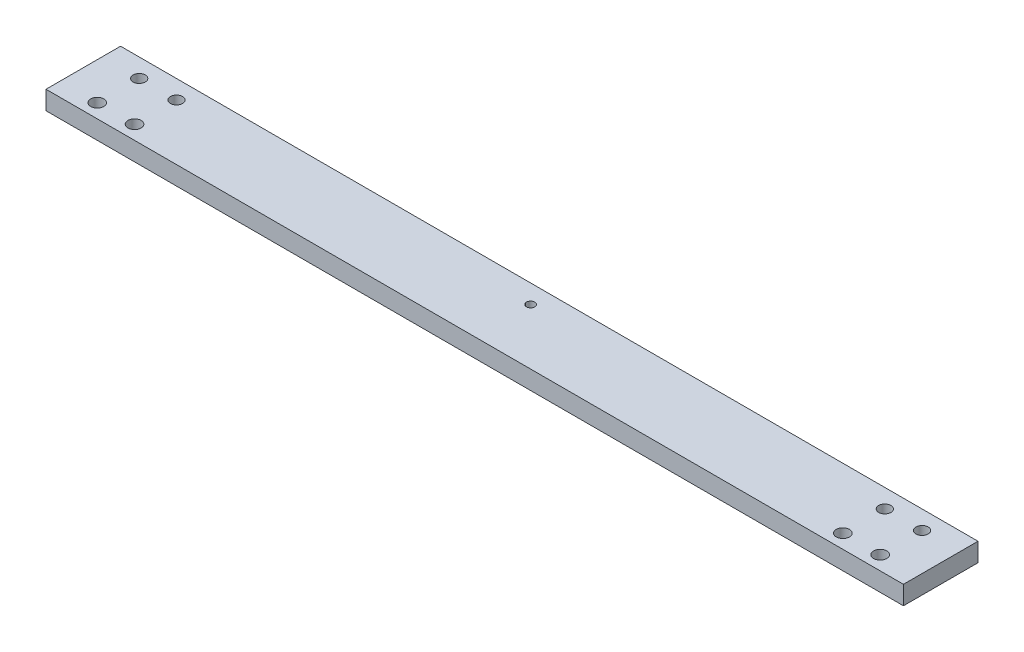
ISO-10303-21;
HEADER;
FILE_DESCRIPTION(('STEP AP214'),'2;1');
FILE_NAME('part.step','',(''),(''),'','','');
FILE_SCHEMA(('AUTOMOTIVE_DESIGN { 1 0 10303 214 1 1 1 1 }'));
ENDSEC;
DATA;
#1=APPLICATION_CONTEXT('core data for automotive mechanical design processes');
#2=APPLICATION_PROTOCOL_DEFINITION('international standard','automotive_design',2000,#1);
#3=PRODUCT_CONTEXT('',#1,'mechanical');
#4=PRODUCT('Part','Part','',(#3));
#5=PRODUCT_RELATED_PRODUCT_CATEGORY('part','',(#4));
#6=PRODUCT_DEFINITION_FORMATION('','',#4);
#7=PRODUCT_DEFINITION_CONTEXT('part definition',#1,'design');
#8=PRODUCT_DEFINITION('design','',#6,#7);
#9=PRODUCT_DEFINITION_SHAPE('','',#8);
#10=(LENGTH_UNIT() NAMED_UNIT(*) SI_UNIT(.MILLI.,.METRE.));
#11=(NAMED_UNIT(*) PLANE_ANGLE_UNIT() SI_UNIT($,.RADIAN.));
#12=(NAMED_UNIT(*) SI_UNIT($,.STERADIAN.) SOLID_ANGLE_UNIT());
#13=UNCERTAINTY_MEASURE_WITH_UNIT(LENGTH_MEASURE(1.E-05),#10,'distance_accuracy_value','');
#14=(GEOMETRIC_REPRESENTATION_CONTEXT(3) GLOBAL_UNCERTAINTY_ASSIGNED_CONTEXT((#13)) GLOBAL_UNIT_ASSIGNED_CONTEXT((#10,
#11,#12)) REPRESENTATION_CONTEXT('',''));
#15=CARTESIAN_POINT('',(0.,0.,0.));
#16=DIRECTION('',(0.,0.,1.));
#17=DIRECTION('',(1.,0.,0.));
#18=AXIS2_PLACEMENT_3D('',#15,#16,#17);
#19=CARTESIAN_POINT('',(0.,6.35,0.));
#20=DIRECTION('',(0.,-1.,0.));
#21=DIRECTION('',(0.,0.,-1.));
#22=AXIS2_PLACEMENT_3D('',#19,#20,#21);
#23=PLANE('',#22);
#24=CARTESIAN_POINT('',(0.,6.35,0.));
#25=DIRECTION('',(0.,1.,0.));
#26=DIRECTION('',(0.,0.,1.));
#27=AXIS2_PLACEMENT_3D('',#24,#25,#26);
#28=CIRCLE('',#27,1.42239999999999);
#29=CARTESIAN_POINT('',(0.,6.35,1.42239999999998));
#30=VERTEX_POINT('',#29);
#31=EDGE_CURVE('E162',#30,#30,#28,.T.);
#32=ORIENTED_EDGE('',*,*,#31,.F.);
#33=EDGE_LOOP('',(#32));
#34=FACE_BOUND('',#33,.T.);
#35=CARTESIAN_POINT('',(120.65,6.35,0.));
#36=DIRECTION('',(0.,1.,0.));
#37=DIRECTION('',(0.,0.,1.));
#38=AXIS2_PLACEMENT_3D('',#35,#36,#37);
#39=CIRCLE('',#38,2.08279999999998);
#40=CARTESIAN_POINT('',(120.65,6.35,2.08279999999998));
#41=VERTEX_POINT('',#40);
#42=EDGE_CURVE('E150',#41,#41,#39,.T.);
#43=ORIENTED_EDGE('',*,*,#42,.F.);
#44=EDGE_LOOP('',(#43));
#45=FACE_BOUND('',#44,.T.);
#46=CARTESIAN_POINT('',(133.35,6.35,14.2875));
#47=DIRECTION('',(0.,1.,0.));
#48=DIRECTION('',(0.,0.,1.));
#49=AXIS2_PLACEMENT_3D('',#46,#47,#48);
#50=CIRCLE('',#49,2.2479);
#51=CARTESIAN_POINT('',(133.35,6.35,16.5354));
#52=VERTEX_POINT('',#51);
#53=EDGE_CURVE('E144',#52,#52,#50,.T.);
#54=ORIENTED_EDGE('',*,*,#53,.F.);
#55=EDGE_LOOP('',(#54));
#56=FACE_BOUND('',#55,.T.);
#57=CARTESIAN_POINT('',(120.65,6.35,14.2875));
#58=DIRECTION('',(0.,1.,0.));
#59=DIRECTION('',(0.,0.,1.));
#60=AXIS2_PLACEMENT_3D('',#57,#58,#59);
#61=CIRCLE('',#60,2.2479);
#62=CARTESIAN_POINT('',(120.65,6.35,16.5354));
#63=VERTEX_POINT('',#62);
#64=EDGE_CURVE('E138',#63,#63,#61,.T.);
#65=ORIENTED_EDGE('',*,*,#64,.F.);
#66=EDGE_LOOP('',(#65));
#67=FACE_BOUND('',#66,.T.);
#68=CARTESIAN_POINT('',(-133.35,6.35,0.));
#69=DIRECTION('',(0.,1.,0.));
#70=DIRECTION('',(0.,0.,1.));
#71=AXIS2_PLACEMENT_3D('',#68,#69,#70);
#72=CIRCLE('',#71,2.0828);
#73=CARTESIAN_POINT('',(-133.35,6.35,2.08279999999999));
#74=VERTEX_POINT('',#73);
#75=EDGE_CURVE('E132',#74,#74,#72,.T.);
#76=ORIENTED_EDGE('',*,*,#75,.F.);
#77=EDGE_LOOP('',(#76));
#78=FACE_BOUND('',#77,.T.);
#79=CARTESIAN_POINT('',(-120.65,6.35,0.));
#80=DIRECTION('',(0.,1.,0.));
#81=DIRECTION('',(0.,0.,1.));
#82=AXIS2_PLACEMENT_3D('',#79,#80,#81);
#83=CIRCLE('',#82,2.08279999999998);
#84=CARTESIAN_POINT('',(-120.65,6.35,2.08279999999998));
#85=VERTEX_POINT('',#84);
#86=EDGE_CURVE('E126',#85,#85,#83,.T.);
#87=ORIENTED_EDGE('',*,*,#86,.F.);
#88=EDGE_LOOP('',(#87));
#89=FACE_BOUND('',#88,.T.);
#90=CARTESIAN_POINT('',(-133.35,6.35,14.2875));
#91=DIRECTION('',(0.,1.,0.));
#92=DIRECTION('',(0.,0.,1.));
#93=AXIS2_PLACEMENT_3D('',#90,#91,#92);
#94=CIRCLE('',#93,2.2479);
#95=CARTESIAN_POINT('',(-133.35,6.35,16.5354));
#96=VERTEX_POINT('',#95);
#97=EDGE_CURVE('E120',#96,#96,#94,.T.);
#98=ORIENTED_EDGE('',*,*,#97,.F.);
#99=EDGE_LOOP('',(#98));
#100=FACE_BOUND('',#99,.T.);
#101=CARTESIAN_POINT('',(-120.65,6.35,14.2875));
#102=DIRECTION('',(0.,1.,0.));
#103=DIRECTION('',(0.,0.,1.));
#104=AXIS2_PLACEMENT_3D('',#101,#102,#103);
#105=CIRCLE('',#104,2.2479);
#106=CARTESIAN_POINT('',(-120.65,6.35,16.5354));
#107=VERTEX_POINT('',#106);
#108=EDGE_CURVE('E114',#107,#107,#105,.T.);
#109=ORIENTED_EDGE('',*,*,#108,.F.);
#110=EDGE_LOOP('',(#109));
#111=FACE_BOUND('',#110,.T.);
#112=DIRECTION('',(0.,0.,-1.));
#113=VECTOR('',#112,1.);
#114=CARTESIAN_POINT('',(146.05,6.35,19.05));
#115=LINE('',#114,#113);
#116=CARTESIAN_POINT('',(146.05,6.35,19.05));
#117=VERTEX_POINT('',#116);
#118=CARTESIAN_POINT('',(146.05,6.35,-6.35));
#119=VERTEX_POINT('',#118);
#120=EDGE_CURVE('E85',#117,#119,#115,.T.);
#121=ORIENTED_EDGE('',*,*,#120,.T.);
#122=DIRECTION('',(-1.,0.,0.));
#123=VECTOR('',#122,1.);
#124=CARTESIAN_POINT('',(-146.05,6.35,-6.35));
#125=LINE('',#124,#123);
#126=CARTESIAN_POINT('',(-146.05,6.35,-6.35));
#127=VERTEX_POINT('',#126);
#128=EDGE_CURVE('E80',#119,#127,#125,.T.);
#129=ORIENTED_EDGE('',*,*,#128,.T.);
#130=DIRECTION('',(0.,0.,1.));
#131=VECTOR('',#130,1.);
#132=CARTESIAN_POINT('',(-146.05,6.35,19.05));
#133=LINE('',#132,#131);
#134=CARTESIAN_POINT('',(-146.05,6.35,19.05));
#135=VERTEX_POINT('',#134);
#136=EDGE_CURVE('E83',#127,#135,#133,.T.);
#137=ORIENTED_EDGE('',*,*,#136,.T.);
#138=DIRECTION('',(1.,0.,0.));
#139=VECTOR('',#138,1.);
#140=CARTESIAN_POINT('',(-146.05,6.35,19.05));
#141=LINE('',#140,#139);
#142=EDGE_CURVE('E50',#135,#117,#141,.T.);
#143=ORIENTED_EDGE('',*,*,#142,.T.);
#144=EDGE_LOOP('',(#121,#129,#137,#143));
#145=FACE_BOUND('',#144,.T.);
#146=CARTESIAN_POINT('',(133.35,6.35,0.));
#147=DIRECTION('',(0.,1.,0.));
#148=DIRECTION('',(0.,0.,1.));
#149=AXIS2_PLACEMENT_3D('',#146,#147,#148);
#150=CIRCLE('',#149,2.0828);
#151=CARTESIAN_POINT('',(133.35,6.35,2.08279999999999));
#152=VERTEX_POINT('',#151);
#153=EDGE_CURVE('E156',#152,#152,#150,.T.);
#154=ORIENTED_EDGE('',*,*,#153,.F.);
#155=EDGE_LOOP('',(#154));
#156=FACE_BOUND('',#155,.T.);
#157=ADVANCED_FACE('F33',(#34,#45,#56,#67,#78,#89,#100,#111,#145,#156),#23,.F.);
#158=CARTESIAN_POINT('',(0.,0.,0.));
#159=DIRECTION('',(0.,-1.,0.));
#160=DIRECTION('',(0.,0.,-1.));
#161=AXIS2_PLACEMENT_3D('',#158,#159,#160);
#162=PLANE('',#161);
#163=CARTESIAN_POINT('',(0.,0.,0.));
#164=DIRECTION('',(0.,1.,0.));
#165=DIRECTION('',(0.,0.,1.));
#166=AXIS2_PLACEMENT_3D('',#163,#164,#165);
#167=CIRCLE('',#166,1.4224);
#168=CARTESIAN_POINT('',(0.,0.,1.4224));
#169=VERTEX_POINT('',#168);
#170=EDGE_CURVE('E159',#169,#169,#167,.T.);
#171=ORIENTED_EDGE('',*,*,#170,.T.);
#172=EDGE_LOOP('',(#171));
#173=FACE_BOUND('',#172,.T.);
#174=CARTESIAN_POINT('',(133.35,0.,0.));
#175=DIRECTION('',(0.,1.,0.));
#176=DIRECTION('',(0.,0.,1.));
#177=AXIS2_PLACEMENT_3D('',#174,#175,#176);
#178=CIRCLE('',#177,2.0828);
#179=CARTESIAN_POINT('',(133.35,0.,2.08279999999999));
#180=VERTEX_POINT('',#179);
#181=EDGE_CURVE('E153',#180,#180,#178,.T.);
#182=ORIENTED_EDGE('',*,*,#181,.T.);
#183=EDGE_LOOP('',(#182));
#184=FACE_BOUND('',#183,.T.);
#185=CARTESIAN_POINT('',(120.65,0.,0.));
#186=DIRECTION('',(0.,1.,0.));
#187=DIRECTION('',(0.,0.,1.));
#188=AXIS2_PLACEMENT_3D('',#185,#186,#187);
#189=CIRCLE('',#188,2.0828);
#190=CARTESIAN_POINT('',(120.65,0.,2.08279999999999));
#191=VERTEX_POINT('',#190);
#192=EDGE_CURVE('E147',#191,#191,#189,.T.);
#193=ORIENTED_EDGE('',*,*,#192,.T.);
#194=EDGE_LOOP('',(#193));
#195=FACE_BOUND('',#194,.T.);
#196=DIRECTION('',(0.,0.,-1.));
#197=VECTOR('',#196,1.);
#198=CARTESIAN_POINT('',(146.05,0.,19.05));
#199=LINE('',#198,#197);
#200=CARTESIAN_POINT('',(146.05,0.,19.05));
#201=VERTEX_POINT('',#200);
#202=CARTESIAN_POINT('',(146.05,0.,-6.35));
#203=VERTEX_POINT('',#202);
#204=EDGE_CURVE('E97',#201,#203,#199,.T.);
#205=ORIENTED_EDGE('',*,*,#204,.F.);
#206=DIRECTION('',(1.,0.,0.));
#207=VECTOR('',#206,1.);
#208=CARTESIAN_POINT('',(-146.05,0.,19.05));
#209=LINE('',#208,#207);
#210=CARTESIAN_POINT('',(-146.05,0.,19.05));
#211=VERTEX_POINT('',#210);
#212=EDGE_CURVE('E73',#211,#201,#209,.T.);
#213=ORIENTED_EDGE('',*,*,#212,.F.);
#214=DIRECTION('',(0.,0.,1.));
#215=VECTOR('',#214,1.);
#216=CARTESIAN_POINT('',(-146.05,0.,19.05));
#217=LINE('',#216,#215);
#218=CARTESIAN_POINT('',(-146.05,0.,-6.35));
#219=VERTEX_POINT('',#218);
#220=EDGE_CURVE('E67',#219,#211,#217,.T.);
#221=ORIENTED_EDGE('',*,*,#220,.F.);
#222=DIRECTION('',(-1.,0.,0.));
#223=VECTOR('',#222,1.);
#224=CARTESIAN_POINT('',(-146.05,0.,-6.35));
#225=LINE('',#224,#223);
#226=EDGE_CURVE('E89',#203,#219,#225,.T.);
#227=ORIENTED_EDGE('',*,*,#226,.F.);
#228=EDGE_LOOP('',(#205,#213,#221,#227));
#229=FACE_BOUND('',#228,.T.);
#230=CARTESIAN_POINT('',(-120.65,0.,14.2875));
#231=DIRECTION('',(0.,1.,0.));
#232=DIRECTION('',(0.,0.,1.));
#233=AXIS2_PLACEMENT_3D('',#230,#231,#232);
#234=CIRCLE('',#233,2.2479);
#235=CARTESIAN_POINT('',(-120.65,0.,16.5354));
#236=VERTEX_POINT('',#235);
#237=EDGE_CURVE('E100',#236,#236,#234,.T.);
#238=ORIENTED_EDGE('',*,*,#237,.T.);
#239=EDGE_LOOP('',(#238));
#240=FACE_BOUND('',#239,.T.);
#241=CARTESIAN_POINT('',(-133.35,0.,14.2875));
#242=DIRECTION('',(0.,1.,0.));
#243=DIRECTION('',(0.,0.,1.));
#244=AXIS2_PLACEMENT_3D('',#241,#242,#243);
#245=CIRCLE('',#244,2.2479);
#246=CARTESIAN_POINT('',(-133.35,0.,16.5354));
#247=VERTEX_POINT('',#246);
#248=EDGE_CURVE('E117',#247,#247,#245,.T.);
#249=ORIENTED_EDGE('',*,*,#248,.T.);
#250=EDGE_LOOP('',(#249));
#251=FACE_BOUND('',#250,.T.);
#252=CARTESIAN_POINT('',(-120.65,0.,0.));
#253=DIRECTION('',(0.,1.,0.));
#254=DIRECTION('',(0.,0.,1.));
#255=AXIS2_PLACEMENT_3D('',#252,#253,#254);
#256=CIRCLE('',#255,2.0828);
#257=CARTESIAN_POINT('',(-120.65,0.,2.08279999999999));
#258=VERTEX_POINT('',#257);
#259=EDGE_CURVE('E123',#258,#258,#256,.T.);
#260=ORIENTED_EDGE('',*,*,#259,.T.);
#261=EDGE_LOOP('',(#260));
#262=FACE_BOUND('',#261,.T.);
#263=CARTESIAN_POINT('',(-133.35,0.,0.));
#264=DIRECTION('',(0.,1.,0.));
#265=DIRECTION('',(0.,0.,1.));
#266=AXIS2_PLACEMENT_3D('',#263,#264,#265);
#267=CIRCLE('',#266,2.0828);
#268=CARTESIAN_POINT('',(-133.35,0.,2.08279999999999));
#269=VERTEX_POINT('',#268);
#270=EDGE_CURVE('E129',#269,#269,#267,.T.);
#271=ORIENTED_EDGE('',*,*,#270,.T.);
#272=EDGE_LOOP('',(#271));
#273=FACE_BOUND('',#272,.T.);
#274=CARTESIAN_POINT('',(120.65,0.,14.2875));
#275=DIRECTION('',(0.,1.,0.));
#276=DIRECTION('',(0.,0.,1.));
#277=AXIS2_PLACEMENT_3D('',#274,#275,#276);
#278=CIRCLE('',#277,2.2479);
#279=CARTESIAN_POINT('',(120.65,0.,16.5354));
#280=VERTEX_POINT('',#279);
#281=EDGE_CURVE('E135',#280,#280,#278,.T.);
#282=ORIENTED_EDGE('',*,*,#281,.T.);
#283=EDGE_LOOP('',(#282));
#284=FACE_BOUND('',#283,.T.);
#285=CARTESIAN_POINT('',(133.35,0.,14.2875));
#286=DIRECTION('',(0.,1.,0.));
#287=DIRECTION('',(0.,0.,1.));
#288=AXIS2_PLACEMENT_3D('',#285,#286,#287);
#289=CIRCLE('',#288,2.2479);
#290=CARTESIAN_POINT('',(133.35,0.,16.5354));
#291=VERTEX_POINT('',#290);
#292=EDGE_CURVE('E141',#291,#291,#289,.T.);
#293=ORIENTED_EDGE('',*,*,#292,.T.);
#294=EDGE_LOOP('',(#293));
#295=FACE_BOUND('',#294,.T.);
#296=ADVANCED_FACE('F108',(#173,#184,#195,#229,#240,#251,#262,#273,#284,#295),#162,.T.);
#297=CARTESIAN_POINT('',(146.05,6.35,19.05));
#298=DIRECTION('',(-1.,0.,0.));
#299=DIRECTION('',(0.,0.,1.));
#300=AXIS2_PLACEMENT_3D('',#297,#298,#299);
#301=PLANE('',#300);
#302=ORIENTED_EDGE('',*,*,#204,.T.);
#303=DIRECTION('',(0.,-1.,0.));
#304=VECTOR('',#303,1.);
#305=CARTESIAN_POINT('',(146.05,6.35,-6.35));
#306=LINE('',#305,#304);
#307=EDGE_CURVE('E11',#119,#203,#306,.T.);
#308=ORIENTED_EDGE('',*,*,#307,.F.);
#309=ORIENTED_EDGE('',*,*,#120,.F.);
#310=DIRECTION('',(0.,-1.,0.));
#311=VECTOR('',#310,1.);
#312=CARTESIAN_POINT('',(146.05,6.35,19.05));
#313=LINE('',#312,#311);
#314=EDGE_CURVE('E93',#117,#201,#313,.T.);
#315=ORIENTED_EDGE('',*,*,#314,.T.);
#316=EDGE_LOOP('',(#302,#308,#309,#315));
#317=FACE_BOUND('',#316,.T.);
#318=ADVANCED_FACE('F35',(#317),#301,.F.);
#319=CARTESIAN_POINT('',(-146.05,6.35,-6.35));
#320=DIRECTION('',(0.,0.,1.));
#321=DIRECTION('',(1.,0.,0.));
#322=AXIS2_PLACEMENT_3D('',#319,#320,#321);
#323=PLANE('',#322);
#324=ORIENTED_EDGE('',*,*,#226,.T.);
#325=DIRECTION('',(0.,-1.,0.));
#326=VECTOR('',#325,1.);
#327=CARTESIAN_POINT('',(-146.05,6.35,-6.35));
#328=LINE('',#327,#326);
#329=EDGE_CURVE('E42',#127,#219,#328,.T.);
#330=ORIENTED_EDGE('',*,*,#329,.F.);
#331=ORIENTED_EDGE('',*,*,#128,.F.);
#332=ORIENTED_EDGE('',*,*,#307,.T.);
#333=EDGE_LOOP('',(#324,#330,#331,#332));
#334=FACE_BOUND('',#333,.T.);
#335=ADVANCED_FACE('F88',(#334),#323,.F.);
#336=CARTESIAN_POINT('',(-146.05,6.35,19.05));
#337=DIRECTION('',(1.,0.,0.));
#338=DIRECTION('',(0.,0.,-1.));
#339=AXIS2_PLACEMENT_3D('',#336,#337,#338);
#340=PLANE('',#339);
#341=ORIENTED_EDGE('',*,*,#220,.T.);
#342=DIRECTION('',(0.,-1.,0.));
#343=VECTOR('',#342,1.);
#344=CARTESIAN_POINT('',(-146.05,6.35,19.05));
#345=LINE('',#344,#343);
#346=EDGE_CURVE('E90',#135,#211,#345,.T.);
#347=ORIENTED_EDGE('',*,*,#346,.F.);
#348=ORIENTED_EDGE('',*,*,#136,.F.);
#349=ORIENTED_EDGE('',*,*,#329,.T.);
#350=EDGE_LOOP('',(#341,#347,#348,#349));
#351=FACE_BOUND('',#350,.T.);
#352=ADVANCED_FACE('F91',(#351),#340,.F.);
#353=CARTESIAN_POINT('',(-146.05,6.35,19.05));
#354=DIRECTION('',(0.,0.,-1.));
#355=DIRECTION('',(-1.,0.,0.));
#356=AXIS2_PLACEMENT_3D('',#353,#354,#355);
#357=PLANE('',#356);
#358=ORIENTED_EDGE('',*,*,#212,.T.);
#359=ORIENTED_EDGE('',*,*,#314,.F.);
#360=ORIENTED_EDGE('',*,*,#142,.F.);
#361=ORIENTED_EDGE('',*,*,#346,.T.);
#362=EDGE_LOOP('',(#358,#359,#360,#361));
#363=FACE_BOUND('',#362,.T.);
#364=ADVANCED_FACE('F105',(#363),#357,.F.);
#365=CARTESIAN_POINT('',(-120.65,6.35,14.2875));
#366=DIRECTION('',(0.,1.,0.));
#367=DIRECTION('',(0.,0.,1.));
#368=AXIS2_PLACEMENT_3D('',#365,#366,#367);
#369=CYLINDRICAL_SURFACE('',#368,2.2479);
#370=ORIENTED_EDGE('',*,*,#237,.F.);
#371=EDGE_LOOP('',(#370));
#372=FACE_BOUND('',#371,.T.);
#373=ORIENTED_EDGE('',*,*,#108,.T.);
#374=EDGE_LOOP('',(#373));
#375=FACE_BOUND('',#374,.T.);
#376=ADVANCED_FACE('F185',(#372,#375),#369,.F.);
#377=CARTESIAN_POINT('',(-133.35,6.35,14.2875));
#378=DIRECTION('',(0.,1.,0.));
#379=DIRECTION('',(0.,0.,1.));
#380=AXIS2_PLACEMENT_3D('',#377,#378,#379);
#381=CYLINDRICAL_SURFACE('',#380,2.2479);
#382=ORIENTED_EDGE('',*,*,#248,.F.);
#383=EDGE_LOOP('',(#382));
#384=FACE_BOUND('',#383,.T.);
#385=ORIENTED_EDGE('',*,*,#97,.T.);
#386=EDGE_LOOP('',(#385));
#387=FACE_BOUND('',#386,.T.);
#388=ADVANCED_FACE('F187',(#384,#387),#381,.F.);
#389=CARTESIAN_POINT('',(-120.65,6.35,0.));
#390=DIRECTION('',(0.,1.,0.));
#391=DIRECTION('',(0.,0.,1.));
#392=AXIS2_PLACEMENT_3D('',#389,#390,#391);
#393=CYLINDRICAL_SURFACE('',#392,2.08279999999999);
#394=ORIENTED_EDGE('',*,*,#259,.F.);
#395=EDGE_LOOP('',(#394));
#396=FACE_BOUND('',#395,.T.);
#397=ORIENTED_EDGE('',*,*,#86,.T.);
#398=EDGE_LOOP('',(#397));
#399=FACE_BOUND('',#398,.T.);
#400=ADVANCED_FACE('F194',(#396,#399),#393,.F.);
#401=CARTESIAN_POINT('',(-133.35,6.35,0.));
#402=DIRECTION('',(0.,1.,0.));
#403=DIRECTION('',(0.,0.,1.));
#404=AXIS2_PLACEMENT_3D('',#401,#402,#403);
#405=CYLINDRICAL_SURFACE('',#404,2.0828);
#406=ORIENTED_EDGE('',*,*,#270,.F.);
#407=EDGE_LOOP('',(#406));
#408=FACE_BOUND('',#407,.T.);
#409=ORIENTED_EDGE('',*,*,#75,.T.);
#410=EDGE_LOOP('',(#409));
#411=FACE_BOUND('',#410,.T.);
#412=ADVANCED_FACE('F262',(#408,#411),#405,.F.);
#413=CARTESIAN_POINT('',(120.65,6.35,14.2875));
#414=DIRECTION('',(0.,1.,0.));
#415=DIRECTION('',(0.,0.,1.));
#416=AXIS2_PLACEMENT_3D('',#413,#414,#415);
#417=CYLINDRICAL_SURFACE('',#416,2.2479);
#418=ORIENTED_EDGE('',*,*,#281,.F.);
#419=EDGE_LOOP('',(#418));
#420=FACE_BOUND('',#419,.T.);
#421=ORIENTED_EDGE('',*,*,#64,.T.);
#422=EDGE_LOOP('',(#421));
#423=FACE_BOUND('',#422,.T.);
#424=ADVANCED_FACE('F252',(#420,#423),#417,.F.);
#425=CARTESIAN_POINT('',(133.35,6.35,14.2875));
#426=DIRECTION('',(0.,1.,0.));
#427=DIRECTION('',(0.,0.,1.));
#428=AXIS2_PLACEMENT_3D('',#425,#426,#427);
#429=CYLINDRICAL_SURFACE('',#428,2.2479);
#430=ORIENTED_EDGE('',*,*,#292,.F.);
#431=EDGE_LOOP('',(#430));
#432=FACE_BOUND('',#431,.T.);
#433=ORIENTED_EDGE('',*,*,#53,.T.);
#434=EDGE_LOOP('',(#433));
#435=FACE_BOUND('',#434,.T.);
#436=ADVANCED_FACE('F243',(#432,#435),#429,.F.);
#437=CARTESIAN_POINT('',(120.65,6.35,0.));
#438=DIRECTION('',(0.,1.,0.));
#439=DIRECTION('',(0.,0.,1.));
#440=AXIS2_PLACEMENT_3D('',#437,#438,#439);
#441=CYLINDRICAL_SURFACE('',#440,2.08279999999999);
#442=ORIENTED_EDGE('',*,*,#192,.F.);
#443=EDGE_LOOP('',(#442));
#444=FACE_BOUND('',#443,.T.);
#445=ORIENTED_EDGE('',*,*,#42,.T.);
#446=EDGE_LOOP('',(#445));
#447=FACE_BOUND('',#446,.T.);
#448=ADVANCED_FACE('F232',(#444,#447),#441,.F.);
#449=CARTESIAN_POINT('',(133.35,6.35,0.));
#450=DIRECTION('',(0.,1.,0.));
#451=DIRECTION('',(0.,0.,1.));
#452=AXIS2_PLACEMENT_3D('',#449,#450,#451);
#453=CYLINDRICAL_SURFACE('',#452,2.0828);
#454=ORIENTED_EDGE('',*,*,#181,.F.);
#455=EDGE_LOOP('',(#454));
#456=FACE_BOUND('',#455,.T.);
#457=ORIENTED_EDGE('',*,*,#153,.T.);
#458=EDGE_LOOP('',(#457));
#459=FACE_BOUND('',#458,.T.);
#460=ADVANCED_FACE('F227',(#456,#459),#453,.F.);
#461=CARTESIAN_POINT('',(0.,6.35,0.));
#462=DIRECTION('',(0.,1.,0.));
#463=DIRECTION('',(0.,0.,1.));
#464=AXIS2_PLACEMENT_3D('',#461,#462,#463);
#465=CYLINDRICAL_SURFACE('',#464,1.42239999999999);
#466=ORIENTED_EDGE('',*,*,#170,.F.);
#467=EDGE_LOOP('',(#466));
#468=FACE_BOUND('',#467,.T.);
#469=ORIENTED_EDGE('',*,*,#31,.T.);
#470=EDGE_LOOP('',(#469));
#471=FACE_BOUND('',#470,.T.);
#472=ADVANCED_FACE('F166',(#468,#471),#465,.F.);
#473=CLOSED_SHELL('',(#157,#296,#318,#335,#352,#364,#376,#388,#400,#412,#424,#436,#448,#460,#472));
#474=MANIFOLD_SOLID_BREP('B2',#473);
#475=ADVANCED_BREP_SHAPE_REPRESENTATION('',(#18,#474),#14);
#476=SHAPE_DEFINITION_REPRESENTATION(#9,#475);
ENDSEC;
END-ISO-10303-21;
